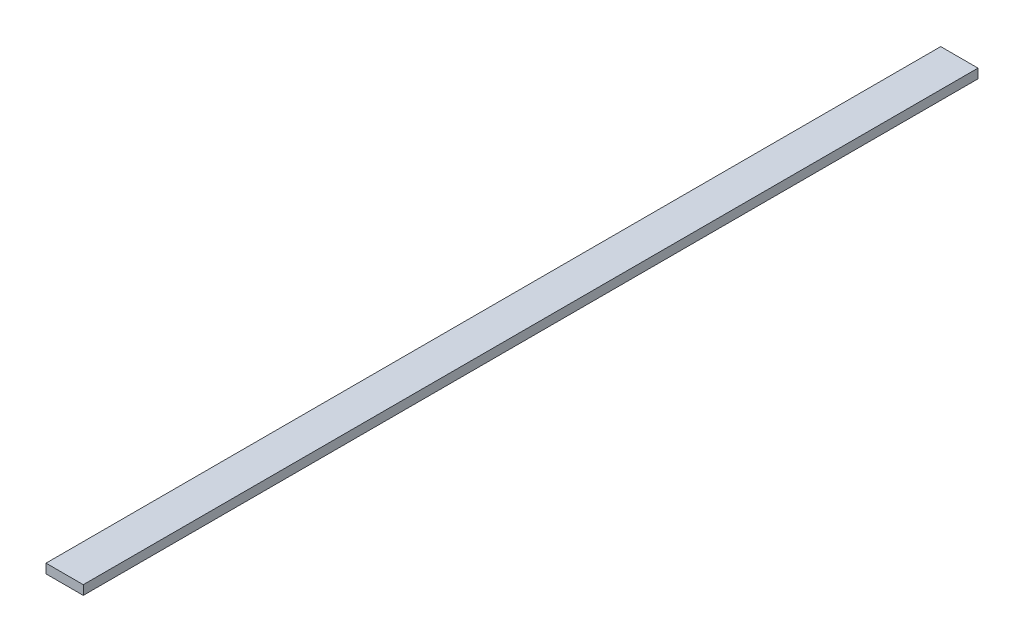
from build123d import *

# Parameters (mm, degrees)
SKETCH1_W           = 101.6
SKETCH1_H           = 25.4
BOSS_EXTRUDE1_DEPTH = 2438.4


with BuildPart() as part:
    # Sketch1 → Boss-Extrude1 (new body)
    with BuildSketch(Plane.XY):
        Rectangle(SKETCH1_W, SKETCH1_H)
    extrude(amount=BOSS_EXTRUDE1_DEPTH)


solid = part.part
